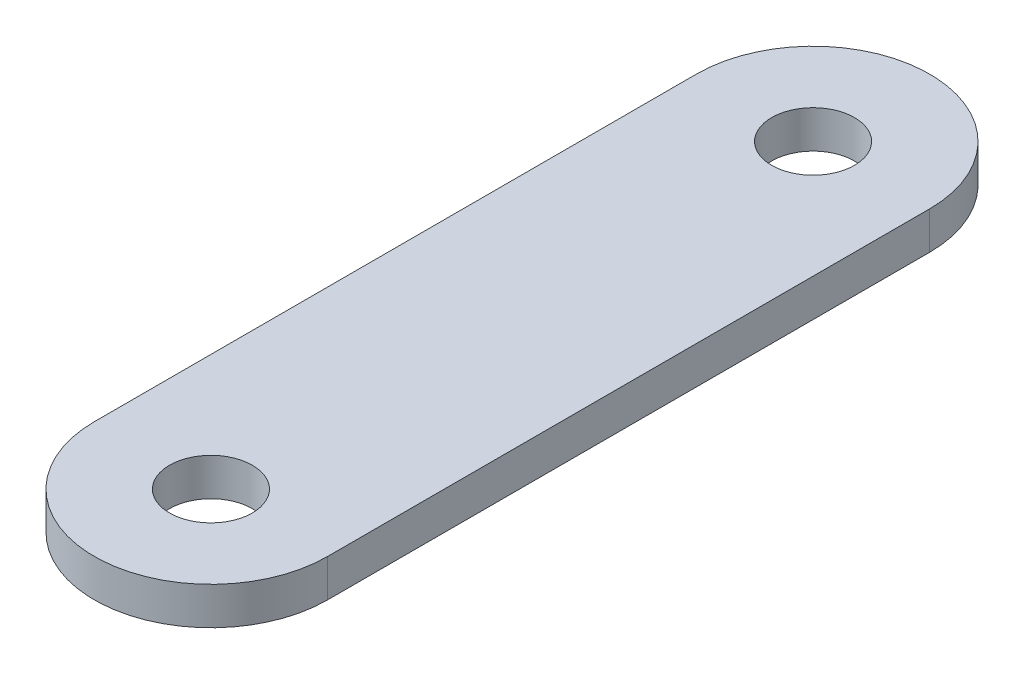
ISO-10303-21;
HEADER;
FILE_DESCRIPTION(('STEP AP214'),'2;1');
FILE_NAME('part.step','',(''),(''),'','','');
FILE_SCHEMA(('AUTOMOTIVE_DESIGN { 1 0 10303 214 1 1 1 1 }'));
ENDSEC;
DATA;
#1=APPLICATION_CONTEXT('core data for automotive mechanical design processes');
#2=APPLICATION_PROTOCOL_DEFINITION('international standard','automotive_design',2000,#1);
#3=PRODUCT_CONTEXT('',#1,'mechanical');
#4=PRODUCT('Part','Part','',(#3));
#5=PRODUCT_RELATED_PRODUCT_CATEGORY('part','',(#4));
#6=PRODUCT_DEFINITION_FORMATION('','',#4);
#7=PRODUCT_DEFINITION_CONTEXT('part definition',#1,'design');
#8=PRODUCT_DEFINITION('design','',#6,#7);
#9=PRODUCT_DEFINITION_SHAPE('','',#8);
#10=(LENGTH_UNIT() NAMED_UNIT(*) SI_UNIT(.MILLI.,.METRE.));
#11=(NAMED_UNIT(*) PLANE_ANGLE_UNIT() SI_UNIT($,.RADIAN.));
#12=(NAMED_UNIT(*) SI_UNIT($,.STERADIAN.) SOLID_ANGLE_UNIT());
#13=UNCERTAINTY_MEASURE_WITH_UNIT(LENGTH_MEASURE(1.E-05),#10,'distance_accuracy_value','');
#14=(GEOMETRIC_REPRESENTATION_CONTEXT(3) GLOBAL_UNCERTAINTY_ASSIGNED_CONTEXT((#13)) GLOBAL_UNIT_ASSIGNED_CONTEXT((#10,
#11,#12)) REPRESENTATION_CONTEXT('',''));
#15=CARTESIAN_POINT('',(0.,0.,0.));
#16=DIRECTION('',(0.,0.,1.));
#17=DIRECTION('',(1.,0.,0.));
#18=AXIS2_PLACEMENT_3D('',#15,#16,#17);
#19=CARTESIAN_POINT('',(0.,1.,-8.));
#20=DIRECTION('',(0.,-1.,0.));
#21=DIRECTION('',(0.,0.,-1.));
#22=AXIS2_PLACEMENT_3D('',#19,#20,#21);
#23=PLANE('',#22);
#24=CARTESIAN_POINT('',(0.,1.,-8.));
#25=DIRECTION('',(0.,1.,0.));
#26=DIRECTION('',(0.,0.,-1.));
#27=AXIS2_PLACEMENT_3D('',#24,#25,#26);
#28=CIRCLE('',#27,3.1);
#29=CARTESIAN_POINT('',(3.1,1.,-8.));
#30=VERTEX_POINT('',#29);
#31=CARTESIAN_POINT('',(-3.1,1.,-8.));
#32=VERTEX_POINT('',#31);
#33=EDGE_CURVE('E87',#30,#32,#28,.T.);
#34=ORIENTED_EDGE('',*,*,#33,.T.);
#35=DIRECTION('',(0.,0.,1.));
#36=VECTOR('',#35,1.);
#37=CARTESIAN_POINT('',(-3.1,1.,-8.));
#38=LINE('',#37,#36);
#39=CARTESIAN_POINT('',(-3.1,1.,8.));
#40=VERTEX_POINT('',#39);
#41=EDGE_CURVE('E115',#32,#40,#38,.T.);
#42=ORIENTED_EDGE('',*,*,#41,.T.);
#43=CARTESIAN_POINT('',(0.,1.,8.));
#44=DIRECTION('',(0.,-1.,0.));
#45=DIRECTION('',(0.,0.,1.));
#46=AXIS2_PLACEMENT_3D('',#43,#44,#45);
#47=CIRCLE('',#46,3.1);
#48=CARTESIAN_POINT('',(3.1,1.,8.));
#49=VERTEX_POINT('',#48);
#50=EDGE_CURVE('E94',#49,#40,#47,.T.);
#51=ORIENTED_EDGE('',*,*,#50,.F.);
#52=DIRECTION('',(0.,0.,-1.));
#53=VECTOR('',#52,1.);
#54=CARTESIAN_POINT('',(3.1,1.,-8.));
#55=LINE('',#54,#53);
#56=EDGE_CURVE('E54',#49,#30,#55,.T.);
#57=ORIENTED_EDGE('',*,*,#56,.T.);
#58=EDGE_LOOP('',(#34,#42,#51,#57));
#59=FACE_BOUND('',#58,.T.);
#60=CARTESIAN_POINT('',(0.,1.,-8.));
#61=DIRECTION('',(0.,1.,0.));
#62=DIRECTION('',(0.,0.,1.));
#63=AXIS2_PLACEMENT_3D('',#60,#61,#62);
#64=CIRCLE('',#63,1.1);
#65=CARTESIAN_POINT('',(0.,1.,-6.9));
#66=VERTEX_POINT('',#65);
#67=EDGE_CURVE('E109',#66,#66,#64,.T.);
#68=ORIENTED_EDGE('',*,*,#67,.F.);
#69=EDGE_LOOP('',(#68));
#70=FACE_BOUND('',#69,.T.);
#71=CARTESIAN_POINT('',(0.,1.,8.));
#72=DIRECTION('',(0.,-1.,0.));
#73=DIRECTION('',(0.,0.,-1.));
#74=AXIS2_PLACEMENT_3D('',#71,#72,#73);
#75=CIRCLE('',#74,1.1);
#76=CARTESIAN_POINT('',(0.,1.,6.9));
#77=VERTEX_POINT('',#76);
#78=EDGE_CURVE('E99',#77,#77,#75,.T.);
#79=ORIENTED_EDGE('',*,*,#78,.T.);
#80=EDGE_LOOP('',(#79));
#81=FACE_BOUND('',#80,.T.);
#82=ADVANCED_FACE('F37',(#59,#70,#81),#23,.F.);
#83=CARTESIAN_POINT('',(0.,0.,-8.));
#84=DIRECTION('',(0.,-1.,0.));
#85=DIRECTION('',(0.,0.,-1.));
#86=AXIS2_PLACEMENT_3D('',#83,#84,#85);
#87=PLANE('',#86);
#88=CARTESIAN_POINT('',(0.,0.,-8.));
#89=DIRECTION('',(0.,1.,0.));
#90=DIRECTION('',(0.,0.,-1.));
#91=AXIS2_PLACEMENT_3D('',#88,#89,#90);
#92=CIRCLE('',#91,3.1);
#93=CARTESIAN_POINT('',(3.1,0.,-8.));
#94=VERTEX_POINT('',#93);
#95=CARTESIAN_POINT('',(-3.1,0.,-8.));
#96=VERTEX_POINT('',#95);
#97=EDGE_CURVE('E85',#94,#96,#92,.T.);
#98=ORIENTED_EDGE('',*,*,#97,.F.);
#99=DIRECTION('',(0.,0.,-1.));
#100=VECTOR('',#99,1.);
#101=CARTESIAN_POINT('',(3.1,0.,-8.));
#102=LINE('',#101,#100);
#103=CARTESIAN_POINT('',(3.1,0.,8.));
#104=VERTEX_POINT('',#103);
#105=EDGE_CURVE('E79',#104,#94,#102,.T.);
#106=ORIENTED_EDGE('',*,*,#105,.F.);
#107=CARTESIAN_POINT('',(0.,0.,8.));
#108=DIRECTION('',(0.,-1.,0.));
#109=DIRECTION('',(0.,0.,1.));
#110=AXIS2_PLACEMENT_3D('',#107,#108,#109);
#111=CIRCLE('',#110,3.1);
#112=CARTESIAN_POINT('',(-3.1,0.,8.));
#113=VERTEX_POINT('',#112);
#114=EDGE_CURVE('E83',#104,#113,#111,.T.);
#115=ORIENTED_EDGE('',*,*,#114,.T.);
#116=DIRECTION('',(0.,0.,1.));
#117=VECTOR('',#116,1.);
#118=CARTESIAN_POINT('',(-3.1,0.,-8.));
#119=LINE('',#118,#117);
#120=EDGE_CURVE('E66',#96,#113,#119,.T.);
#121=ORIENTED_EDGE('',*,*,#120,.F.);
#122=EDGE_LOOP('',(#98,#106,#115,#121));
#123=FACE_BOUND('',#122,.T.);
#124=CARTESIAN_POINT('',(0.,0.,-8.));
#125=DIRECTION('',(0.,1.,0.));
#126=DIRECTION('',(0.,0.,1.));
#127=AXIS2_PLACEMENT_3D('',#124,#125,#126);
#128=CIRCLE('',#127,1.1);
#129=CARTESIAN_POINT('',(0.,0.,-6.9));
#130=VERTEX_POINT('',#129);
#131=EDGE_CURVE('E108',#130,#130,#128,.T.);
#132=ORIENTED_EDGE('',*,*,#131,.T.);
#133=EDGE_LOOP('',(#132));
#134=FACE_BOUND('',#133,.T.);
#135=CARTESIAN_POINT('',(0.,0.,8.));
#136=DIRECTION('',(0.,-1.,0.));
#137=DIRECTION('',(0.,0.,-1.));
#138=AXIS2_PLACEMENT_3D('',#135,#136,#137);
#139=CIRCLE('',#138,1.1);
#140=CARTESIAN_POINT('',(0.,0.,6.9));
#141=VERTEX_POINT('',#140);
#142=EDGE_CURVE('E103',#141,#141,#139,.T.);
#143=ORIENTED_EDGE('',*,*,#142,.F.);
#144=EDGE_LOOP('',(#143));
#145=FACE_BOUND('',#144,.T.);
#146=ADVANCED_FACE('F80',(#123,#134,#145),#87,.T.);
#147=CARTESIAN_POINT('',(0.,1.,-8.));
#148=DIRECTION('',(0.,-1.,0.));
#149=DIRECTION('',(0.,0.,-1.));
#150=AXIS2_PLACEMENT_3D('',#147,#148,#149);
#151=CYLINDRICAL_SURFACE('',#150,3.1);
#152=ORIENTED_EDGE('',*,*,#97,.T.);
#153=DIRECTION('',(0.,-1.,0.));
#154=VECTOR('',#153,1.);
#155=CARTESIAN_POINT('',(-3.1,1.,-8.));
#156=LINE('',#155,#154);
#157=EDGE_CURVE('E11',#32,#96,#156,.T.);
#158=ORIENTED_EDGE('',*,*,#157,.F.);
#159=ORIENTED_EDGE('',*,*,#33,.F.);
#160=DIRECTION('',(0.,-1.,0.));
#161=VECTOR('',#160,1.);
#162=CARTESIAN_POINT('',(3.1,1.,-8.));
#163=LINE('',#162,#161);
#164=EDGE_CURVE('E46',#30,#94,#163,.T.);
#165=ORIENTED_EDGE('',*,*,#164,.T.);
#166=EDGE_LOOP('',(#152,#158,#159,#165));
#167=FACE_BOUND('',#166,.T.);
#168=ADVANCED_FACE('F39',(#167),#151,.T.);
#169=CARTESIAN_POINT('',(-3.1,1.,-8.));
#170=DIRECTION('',(1.,0.,0.));
#171=DIRECTION('',(0.,0.,-1.));
#172=AXIS2_PLACEMENT_3D('',#169,#170,#171);
#173=PLANE('',#172);
#174=ORIENTED_EDGE('',*,*,#120,.T.);
#175=DIRECTION('',(0.,-1.,0.));
#176=VECTOR('',#175,1.);
#177=CARTESIAN_POINT('',(-3.1,1.,8.));
#178=LINE('',#177,#176);
#179=EDGE_CURVE('E93',#40,#113,#178,.T.);
#180=ORIENTED_EDGE('',*,*,#179,.F.);
#181=ORIENTED_EDGE('',*,*,#41,.F.);
#182=ORIENTED_EDGE('',*,*,#157,.T.);
#183=EDGE_LOOP('',(#174,#180,#181,#182));
#184=FACE_BOUND('',#183,.T.);
#185=ADVANCED_FACE('F124',(#184),#173,.F.);
#186=CARTESIAN_POINT('',(3.1,1.,-8.));
#187=DIRECTION('',(-1.,0.,0.));
#188=DIRECTION('',(0.,0.,1.));
#189=AXIS2_PLACEMENT_3D('',#186,#187,#188);
#190=PLANE('',#189);
#191=ORIENTED_EDGE('',*,*,#105,.T.);
#192=ORIENTED_EDGE('',*,*,#164,.F.);
#193=ORIENTED_EDGE('',*,*,#56,.F.);
#194=DIRECTION('',(0.,-1.,0.));
#195=VECTOR('',#194,1.);
#196=CARTESIAN_POINT('',(3.1,1.,8.));
#197=LINE('',#196,#195);
#198=EDGE_CURVE('E89',#49,#104,#197,.T.);
#199=ORIENTED_EDGE('',*,*,#198,.T.);
#200=EDGE_LOOP('',(#191,#192,#193,#199));
#201=FACE_BOUND('',#200,.T.);
#202=ADVANCED_FACE('F90',(#201),#190,.F.);
#203=CARTESIAN_POINT('',(0.,1.,-8.));
#204=DIRECTION('',(0.,-1.,0.));
#205=DIRECTION('',(0.,0.,-1.));
#206=AXIS2_PLACEMENT_3D('',#203,#204,#205);
#207=CYLINDRICAL_SURFACE('',#206,1.1);
#208=ORIENTED_EDGE('',*,*,#67,.T.);
#209=EDGE_LOOP('',(#208));
#210=FACE_BOUND('',#209,.T.);
#211=ORIENTED_EDGE('',*,*,#131,.F.);
#212=EDGE_LOOP('',(#211));
#213=FACE_BOUND('',#212,.T.);
#214=ADVANCED_FACE('F130',(#210,#213),#207,.F.);
#215=CARTESIAN_POINT('',(0.,1.,8.));
#216=DIRECTION('',(0.,-1.,0.));
#217=DIRECTION('',(0.,0.,1.));
#218=AXIS2_PLACEMENT_3D('',#215,#216,#217);
#219=CYLINDRICAL_SURFACE('',#218,3.1);
#220=ORIENTED_EDGE('',*,*,#114,.F.);
#221=ORIENTED_EDGE('',*,*,#198,.F.);
#222=ORIENTED_EDGE('',*,*,#50,.T.);
#223=ORIENTED_EDGE('',*,*,#179,.T.);
#224=EDGE_LOOP('',(#220,#221,#222,#223));
#225=FACE_BOUND('',#224,.T.);
#226=ADVANCED_FACE('F97',(#225),#219,.T.);
#227=CARTESIAN_POINT('',(0.,1.,8.));
#228=DIRECTION('',(0.,-1.,0.));
#229=DIRECTION('',(0.,0.,1.));
#230=AXIS2_PLACEMENT_3D('',#227,#228,#229);
#231=CYLINDRICAL_SURFACE('',#230,1.1);
#232=ORIENTED_EDGE('',*,*,#78,.F.);
#233=EDGE_LOOP('',(#232));
#234=FACE_BOUND('',#233,.T.);
#235=ORIENTED_EDGE('',*,*,#142,.T.);
#236=EDGE_LOOP('',(#235));
#237=FACE_BOUND('',#236,.T.);
#238=ADVANCED_FACE('F144',(#234,#237),#231,.F.);
#239=CLOSED_SHELL('',(#82,#146,#168,#185,#202,#214,#226,#238));
#240=MANIFOLD_SOLID_BREP('B2',#239);
#241=ADVANCED_BREP_SHAPE_REPRESENTATION('',(#18,#240),#14);
#242=SHAPE_DEFINITION_REPRESENTATION(#9,#241);
ENDSEC;
END-ISO-10303-21;
